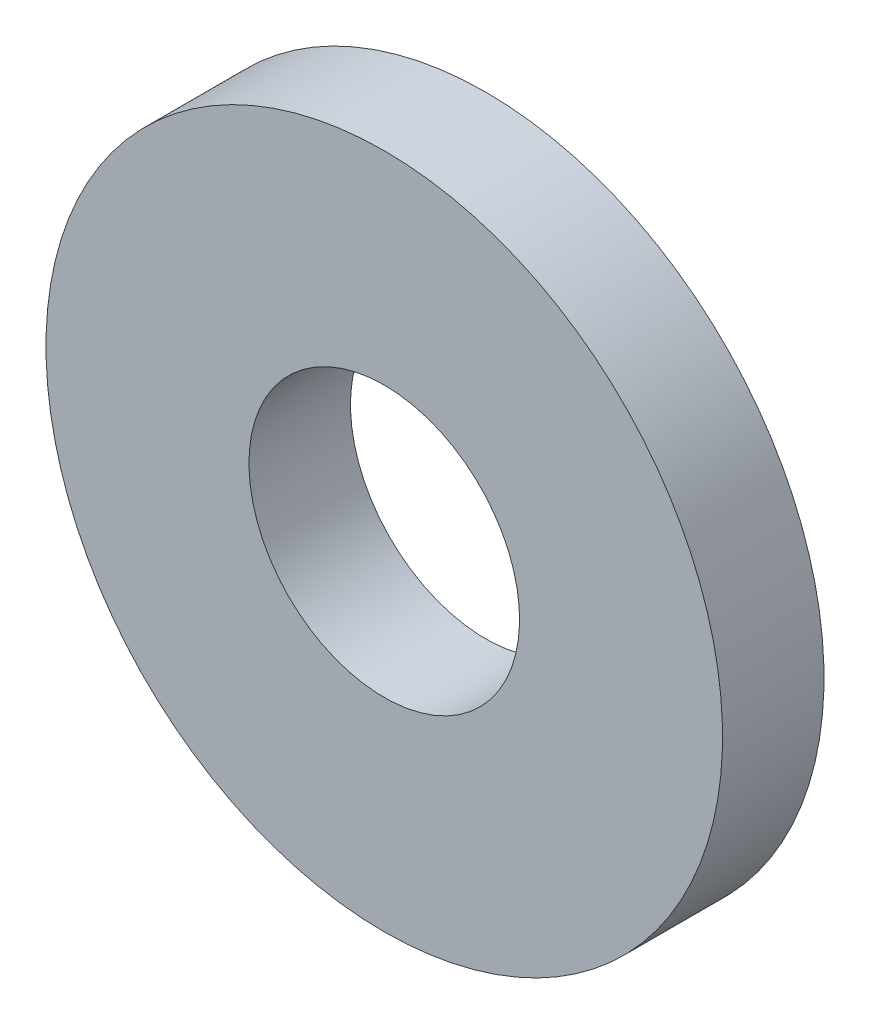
ISO-10303-21;
HEADER;
FILE_DESCRIPTION(('STEP AP214'),'2;1');
FILE_NAME('part.step','',(''),(''),'','','');
FILE_SCHEMA(('AUTOMOTIVE_DESIGN { 1 0 10303 214 1 1 1 1 }'));
ENDSEC;
DATA;
#1=APPLICATION_CONTEXT('core data for automotive mechanical design processes');
#2=APPLICATION_PROTOCOL_DEFINITION('international standard','automotive_design',2000,#1);
#3=PRODUCT_CONTEXT('',#1,'mechanical');
#4=PRODUCT('Part','Part','',(#3));
#5=PRODUCT_RELATED_PRODUCT_CATEGORY('part','',(#4));
#6=PRODUCT_DEFINITION_FORMATION('','',#4);
#7=PRODUCT_DEFINITION_CONTEXT('part definition',#1,'design');
#8=PRODUCT_DEFINITION('design','',#6,#7);
#9=PRODUCT_DEFINITION_SHAPE('','',#8);
#10=(LENGTH_UNIT() NAMED_UNIT(*) SI_UNIT(.MILLI.,.METRE.));
#11=(NAMED_UNIT(*) PLANE_ANGLE_UNIT() SI_UNIT($,.RADIAN.));
#12=(NAMED_UNIT(*) SI_UNIT($,.STERADIAN.) SOLID_ANGLE_UNIT());
#13=UNCERTAINTY_MEASURE_WITH_UNIT(LENGTH_MEASURE(1.E-05),#10,'distance_accuracy_value','');
#14=(GEOMETRIC_REPRESENTATION_CONTEXT(3) GLOBAL_UNCERTAINTY_ASSIGNED_CONTEXT((#13)) GLOBAL_UNIT_ASSIGNED_CONTEXT((#10,
#11,#12)) REPRESENTATION_CONTEXT('',''));
#15=CARTESIAN_POINT('',(0.,0.,0.));
#16=DIRECTION('',(0.,0.,1.));
#17=DIRECTION('',(1.,0.,0.));
#18=AXIS2_PLACEMENT_3D('',#15,#16,#17);
#19=CARTESIAN_POINT('',(0.,0.,0.));
#20=DIRECTION('',(0.,0.,-1.));
#21=DIRECTION('',(0.,1.,0.));
#22=AXIS2_PLACEMENT_3D('',#19,#20,#21);
#23=PLANE('',#22);
#24=CARTESIAN_POINT('',(0.,0.,0.));
#25=DIRECTION('',(0.,0.,-1.));
#26=DIRECTION('',(0.,1.,0.));
#27=AXIS2_PLACEMENT_3D('',#24,#25,#26);
#28=CIRCLE('',#27,10.);
#29=CARTESIAN_POINT('',(0.,10.,0.));
#30=VERTEX_POINT('',#29);
#31=EDGE_CURVE('E8',#30,#30,#28,.T.);
#32=ORIENTED_EDGE('',*,*,#31,.T.);
#33=EDGE_LOOP('',(#32));
#34=FACE_BOUND('',#33,.T.);
#35=CARTESIAN_POINT('',(0.,0.,0.));
#36=DIRECTION('',(0.,0.,-1.));
#37=DIRECTION('',(0.,1.,0.));
#38=AXIS2_PLACEMENT_3D('',#35,#36,#37);
#39=CIRCLE('',#38,4.);
#40=CARTESIAN_POINT('',(0.,4.,0.));
#41=VERTEX_POINT('',#40);
#42=EDGE_CURVE('E23',#41,#41,#39,.T.);
#43=ORIENTED_EDGE('',*,*,#42,.F.);
#44=EDGE_LOOP('',(#43));
#45=FACE_BOUND('',#44,.T.);
#46=ADVANCED_FACE('F12',(#34,#45),#23,.T.);
#47=CARTESIAN_POINT('',(0.,0.,3.));
#48=DIRECTION('',(0.,0.,-1.));
#49=DIRECTION('',(0.,1.,0.));
#50=AXIS2_PLACEMENT_3D('',#47,#48,#49);
#51=PLANE('',#50);
#52=CARTESIAN_POINT('',(0.,0.,3.));
#53=DIRECTION('',(0.,0.,-1.));
#54=DIRECTION('',(0.,1.,0.));
#55=AXIS2_PLACEMENT_3D('',#52,#53,#54);
#56=CIRCLE('',#55,10.);
#57=CARTESIAN_POINT('',(0.,10.,3.));
#58=VERTEX_POINT('',#57);
#59=EDGE_CURVE('E19',#58,#58,#56,.T.);
#60=ORIENTED_EDGE('',*,*,#59,.F.);
#61=EDGE_LOOP('',(#60));
#62=FACE_BOUND('',#61,.T.);
#63=CARTESIAN_POINT('',(0.,0.,3.));
#64=DIRECTION('',(0.,0.,-1.));
#65=DIRECTION('',(0.,1.,0.));
#66=AXIS2_PLACEMENT_3D('',#63,#64,#65);
#67=CIRCLE('',#66,4.);
#68=CARTESIAN_POINT('',(0.,4.,3.));
#69=VERTEX_POINT('',#68);
#70=EDGE_CURVE('E27',#69,#69,#67,.T.);
#71=ORIENTED_EDGE('',*,*,#70,.T.);
#72=EDGE_LOOP('',(#71));
#73=FACE_BOUND('',#72,.T.);
#74=ADVANCED_FACE('F33',(#62,#73),#51,.F.);
#75=CARTESIAN_POINT('',(0.,0.,0.));
#76=DIRECTION('',(0.,0.,1.));
#77=DIRECTION('',(0.,-1.,0.));
#78=AXIS2_PLACEMENT_3D('',#75,#76,#77);
#79=CYLINDRICAL_SURFACE('',#78,10.);
#80=ORIENTED_EDGE('',*,*,#31,.F.);
#81=EDGE_LOOP('',(#80));
#82=FACE_BOUND('',#81,.T.);
#83=ORIENTED_EDGE('',*,*,#59,.T.);
#84=EDGE_LOOP('',(#83));
#85=FACE_BOUND('',#84,.T.);
#86=ADVANCED_FACE('F14',(#82,#85),#79,.T.);
#87=CARTESIAN_POINT('',(0.,0.,0.));
#88=DIRECTION('',(0.,0.,1.));
#89=DIRECTION('',(0.,-1.,0.));
#90=AXIS2_PLACEMENT_3D('',#87,#88,#89);
#91=CYLINDRICAL_SURFACE('',#90,4.);
#92=ORIENTED_EDGE('',*,*,#42,.T.);
#93=EDGE_LOOP('',(#92));
#94=FACE_BOUND('',#93,.T.);
#95=ORIENTED_EDGE('',*,*,#70,.F.);
#96=EDGE_LOOP('',(#95));
#97=FACE_BOUND('',#96,.T.);
#98=ADVANCED_FACE('F35',(#94,#97),#91,.F.);
#99=CLOSED_SHELL('',(#46,#74,#86,#98));
#100=MANIFOLD_SOLID_BREP('B1',#99);
#101=ADVANCED_BREP_SHAPE_REPRESENTATION('',(#18,#100),#14);
#102=SHAPE_DEFINITION_REPRESENTATION(#9,#101);
ENDSEC;
END-ISO-10303-21;
